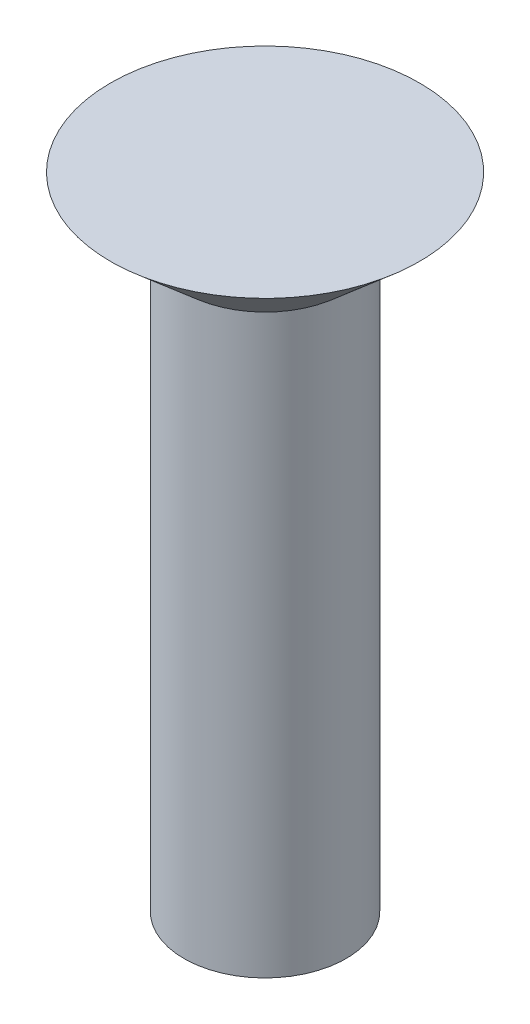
ISO-10303-21;
HEADER;
FILE_DESCRIPTION(('STEP AP214'),'2;1');
FILE_NAME('part.step','',(''),(''),'','','');
FILE_SCHEMA(('AUTOMOTIVE_DESIGN { 1 0 10303 214 1 1 1 1 }'));
ENDSEC;
DATA;
#1=APPLICATION_CONTEXT('core data for automotive mechanical design processes');
#2=APPLICATION_PROTOCOL_DEFINITION('international standard','automotive_design',2000,#1);
#3=PRODUCT_CONTEXT('',#1,'mechanical');
#4=PRODUCT('Part','Part','',(#3));
#5=PRODUCT_RELATED_PRODUCT_CATEGORY('part','',(#4));
#6=PRODUCT_DEFINITION_FORMATION('','',#4);
#7=PRODUCT_DEFINITION_CONTEXT('part definition',#1,'design');
#8=PRODUCT_DEFINITION('design','',#6,#7);
#9=PRODUCT_DEFINITION_SHAPE('','',#8);
#10=(LENGTH_UNIT() NAMED_UNIT(*) SI_UNIT(.MILLI.,.METRE.));
#11=(NAMED_UNIT(*) PLANE_ANGLE_UNIT() SI_UNIT($,.RADIAN.));
#12=(NAMED_UNIT(*) SI_UNIT($,.STERADIAN.) SOLID_ANGLE_UNIT());
#13=UNCERTAINTY_MEASURE_WITH_UNIT(LENGTH_MEASURE(1.E-05),#10,'distance_accuracy_value','');
#14=(GEOMETRIC_REPRESENTATION_CONTEXT(3) GLOBAL_UNCERTAINTY_ASSIGNED_CONTEXT((#13)) GLOBAL_UNIT_ASSIGNED_CONTEXT((#10,
#11,#12)) REPRESENTATION_CONTEXT('',''));
#15=CARTESIAN_POINT('',(0.,0.,0.));
#16=DIRECTION('',(0.,0.,1.));
#17=DIRECTION('',(1.,0.,0.));
#18=AXIS2_PLACEMENT_3D('',#15,#16,#17);
#19=CARTESIAN_POINT('',(0.,0.,0.));
#20=DIRECTION('',(0.,-1.,0.));
#21=DIRECTION('',(1.,0.,0.));
#22=AXIS2_PLACEMENT_3D('',#19,#20,#21);
#23=PLANE('',#22);
#24=CARTESIAN_POINT('',(0.,0.,0.));
#25=DIRECTION('',(0.,1.,0.));
#26=DIRECTION('',(-1.,0.,0.));
#27=AXIS2_PLACEMENT_3D('',#24,#25,#26);
#28=CIRCLE('',#27,4.5974);
#29=CARTESIAN_POINT('',(-4.5974,0.,0.));
#30=VERTEX_POINT('',#29);
#31=EDGE_CURVE('E10',#30,#30,#28,.T.);
#32=ORIENTED_EDGE('',*,*,#31,.T.);
#33=EDGE_LOOP('',(#32));
#34=FACE_BOUND('',#33,.T.);
#35=ADVANCED_FACE('F31',(#34),#23,.F.);
#36=CARTESIAN_POINT('',(0.,-1.89886995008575,0.));
#37=DIRECTION('',(0.,1.,0.));
#38=DIRECTION('',(-1.,0.,0.));
#39=AXIS2_PLACEMENT_3D('',#36,#37,#38);
#40=CONICAL_SURFACE('',#39,2.413,0.855211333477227);
#41=ORIENTED_EDGE('',*,*,#31,.F.);
#42=EDGE_LOOP('',(#41));
#43=FACE_BOUND('',#42,.T.);
#44=CARTESIAN_POINT('',(0.,-1.89886995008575,0.));
#45=DIRECTION('',(0.,1.,0.));
#46=DIRECTION('',(-1.,0.,0.));
#47=AXIS2_PLACEMENT_3D('',#44,#45,#46);
#48=CIRCLE('',#47,2.413);
#49=CARTESIAN_POINT('',(-2.413,-1.89886995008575,0.));
#50=VERTEX_POINT('',#49);
#51=EDGE_CURVE('E37',#50,#50,#48,.T.);
#52=ORIENTED_EDGE('',*,*,#51,.T.);
#53=EDGE_LOOP('',(#52));
#54=FACE_BOUND('',#53,.T.);
#55=ADVANCED_FACE('F56',(#43,#54),#40,.T.);
#56=CARTESIAN_POINT('',(0.,0.,0.));
#57=DIRECTION('',(0.,1.,0.));
#58=DIRECTION('',(-1.,0.,0.));
#59=AXIS2_PLACEMENT_3D('',#56,#57,#58);
#60=CYLINDRICAL_SURFACE('',#59,2.413);
#61=ORIENTED_EDGE('',*,*,#51,.F.);
#62=EDGE_LOOP('',(#61));
#63=FACE_BOUND('',#62,.T.);
#64=CARTESIAN_POINT('',(0.,-19.05,0.));
#65=DIRECTION('',(0.,1.,0.));
#66=DIRECTION('',(-1.,0.,0.));
#67=AXIS2_PLACEMENT_3D('',#64,#65,#66);
#68=CIRCLE('',#67,2.413);
#69=CARTESIAN_POINT('',(-2.413,-19.05,0.));
#70=VERTEX_POINT('',#69);
#71=EDGE_CURVE('E41',#70,#70,#68,.T.);
#72=ORIENTED_EDGE('',*,*,#71,.T.);
#73=EDGE_LOOP('',(#72));
#74=FACE_BOUND('',#73,.T.);
#75=ADVANCED_FACE('F48',(#63,#74),#60,.T.);
#76=CARTESIAN_POINT('',(2.413,-19.05,0.));
#77=DIRECTION('',(0.,1.,0.));
#78=DIRECTION('',(-1.,0.,0.));
#79=AXIS2_PLACEMENT_3D('',#76,#77,#78);
#80=PLANE('',#79);
#81=ORIENTED_EDGE('',*,*,#71,.F.);
#82=EDGE_LOOP('',(#81));
#83=FACE_BOUND('',#82,.T.);
#84=ADVANCED_FACE('F50',(#83),#80,.F.);
#85=CLOSED_SHELL('',(#35,#55,#75,#84));
#86=MANIFOLD_SOLID_BREP('B2',#85);
#87=ADVANCED_BREP_SHAPE_REPRESENTATION('',(#18,#86),#14);
#88=SHAPE_DEFINITION_REPRESENTATION(#9,#87);
ENDSEC;
END-ISO-10303-21;
